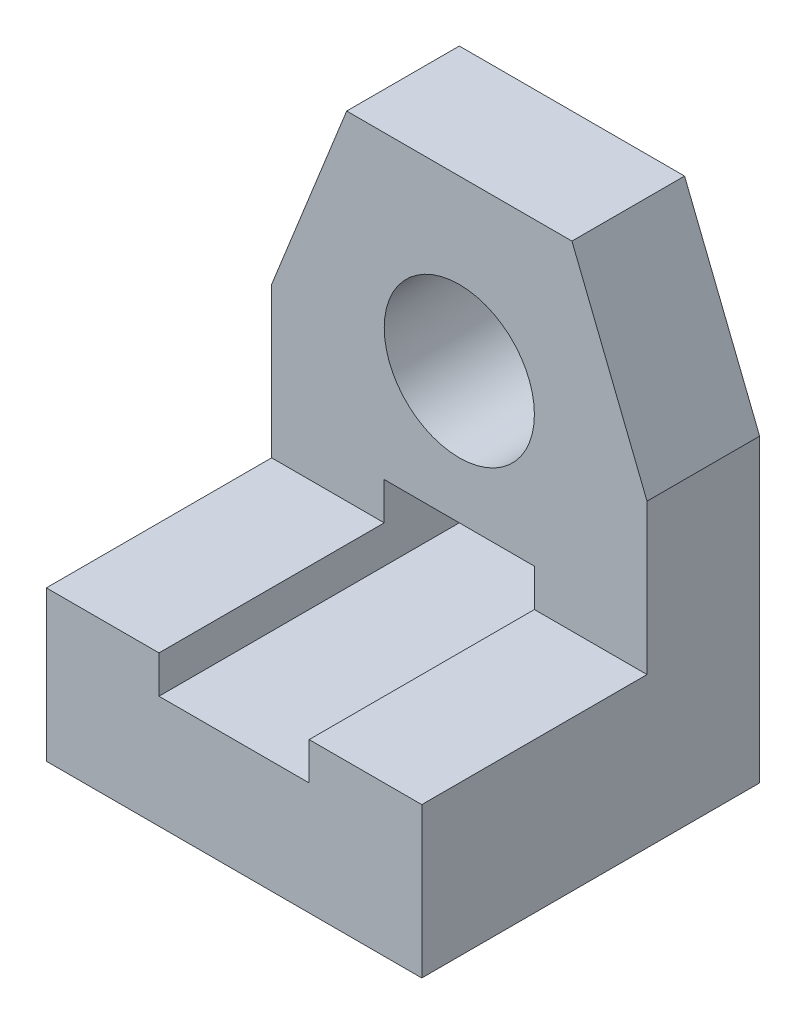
ISO-10303-21;
HEADER;
FILE_DESCRIPTION(('STEP AP214'),'2;1');
FILE_NAME('part.step','',(''),(''),'','','');
FILE_SCHEMA(('AUTOMOTIVE_DESIGN { 1 0 10303 214 1 1 1 1 }'));
ENDSEC;
DATA;
#1=APPLICATION_CONTEXT('core data for automotive mechanical design processes');
#2=APPLICATION_PROTOCOL_DEFINITION('international standard','automotive_design',2000,#1);
#3=PRODUCT_CONTEXT('',#1,'mechanical');
#4=PRODUCT('Part','Part','',(#3));
#5=PRODUCT_RELATED_PRODUCT_CATEGORY('part','',(#4));
#6=PRODUCT_DEFINITION_FORMATION('','',#4);
#7=PRODUCT_DEFINITION_CONTEXT('part definition',#1,'design');
#8=PRODUCT_DEFINITION('design','',#6,#7);
#9=PRODUCT_DEFINITION_SHAPE('','',#8);
#10=(LENGTH_UNIT() NAMED_UNIT(*) SI_UNIT(.MILLI.,.METRE.));
#11=(NAMED_UNIT(*) PLANE_ANGLE_UNIT() SI_UNIT($,.RADIAN.));
#12=(NAMED_UNIT(*) SI_UNIT($,.STERADIAN.) SOLID_ANGLE_UNIT());
#13=UNCERTAINTY_MEASURE_WITH_UNIT(LENGTH_MEASURE(1.E-05),#10,'distance_accuracy_value','');
#14=(GEOMETRIC_REPRESENTATION_CONTEXT(3) GLOBAL_UNCERTAINTY_ASSIGNED_CONTEXT((#13)) GLOBAL_UNIT_ASSIGNED_CONTEXT((#10,
#11,#12)) REPRESENTATION_CONTEXT('',''));
#15=CARTESIAN_POINT('',(0.,0.,0.));
#16=DIRECTION('',(0.,0.,1.));
#17=DIRECTION('',(1.,0.,0.));
#18=AXIS2_PLACEMENT_3D('',#15,#16,#17);
#19=CARTESIAN_POINT('',(0.,20.,-45.));
#20=DIRECTION('',(0.,-1.,0.));
#21=DIRECTION('',(0.,0.,-1.));
#22=AXIS2_PLACEMENT_3D('',#19,#20,#21);
#23=PLANE('',#22);
#24=DIRECTION('',(1.,0.,0.));
#25=VECTOR('',#24,1.);
#26=CARTESIAN_POINT('',(0.,20.,0.));
#27=LINE('',#26,#25);
#28=CARTESIAN_POINT('',(0.,20.,0.));
#29=VERTEX_POINT('',#28);
#30=CARTESIAN_POINT('',(15.,20.,0.));
#31=VERTEX_POINT('',#30);
#32=EDGE_CURVE('E214',#29,#31,#27,.T.);
#33=ORIENTED_EDGE('',*,*,#32,.T.);
#34=DIRECTION('',(0.,0.,-1.));
#35=VECTOR('',#34,1.);
#36=CARTESIAN_POINT('',(15.,20.,-45.));
#37=LINE('',#36,#35);
#38=CARTESIAN_POINT('',(15.,20.,-30.));
#39=VERTEX_POINT('',#38);
#40=EDGE_CURVE('E169',#31,#39,#37,.T.);
#41=ORIENTED_EDGE('',*,*,#40,.T.);
#42=DIRECTION('',(-1.,0.,0.));
#43=VECTOR('',#42,1.);
#44=CARTESIAN_POINT('',(0.,20.,-30.));
#45=LINE('',#44,#43);
#46=CARTESIAN_POINT('',(0.,20.,-30.));
#47=VERTEX_POINT('',#46);
#48=EDGE_CURVE('E189',#39,#47,#45,.T.);
#49=ORIENTED_EDGE('',*,*,#48,.T.);
#50=DIRECTION('',(0.,0.,1.));
#51=VECTOR('',#50,1.);
#52=CARTESIAN_POINT('',(0.,20.,0.));
#53=LINE('',#52,#51);
#54=EDGE_CURVE('E212',#47,#29,#53,.T.);
#55=ORIENTED_EDGE('',*,*,#54,.T.);
#56=EDGE_LOOP('',(#33,#41,#49,#55));
#57=FACE_BOUND('',#56,.T.);
#58=ADVANCED_FACE('F31',(#57),#23,.F.);
#59=CARTESIAN_POINT('',(0.,20.,0.));
#60=DIRECTION('',(1.,0.,0.));
#61=DIRECTION('',(0.,0.,-1.));
#62=AXIS2_PLACEMENT_3D('',#59,#60,#61);
#63=PLANE('',#62);
#64=DIRECTION('',(0.,0.,1.));
#65=VECTOR('',#64,1.);
#66=CARTESIAN_POINT('',(0.,0.,0.));
#67=LINE('',#66,#65);
#68=CARTESIAN_POINT('',(0.,0.,-45.));
#69=VERTEX_POINT('',#68);
#70=CARTESIAN_POINT('',(0.,0.,0.));
#71=VERTEX_POINT('',#70);
#72=EDGE_CURVE('E260',#69,#71,#67,.T.);
#73=ORIENTED_EDGE('',*,*,#72,.T.);
#74=DIRECTION('',(0.,-1.,0.));
#75=VECTOR('',#74,1.);
#76=CARTESIAN_POINT('',(0.,20.,0.));
#77=LINE('',#76,#75);
#78=EDGE_CURVE('E196',#29,#71,#77,.T.);
#79=ORIENTED_EDGE('',*,*,#78,.F.);
#80=ORIENTED_EDGE('',*,*,#54,.F.);
#81=DIRECTION('',(0.,1.,0.));
#82=VECTOR('',#81,1.);
#83=CARTESIAN_POINT('',(0.,20.,-30.));
#84=LINE('',#83,#82);
#85=CARTESIAN_POINT('',(0.,40.,-30.));
#86=VERTEX_POINT('',#85);
#87=EDGE_CURVE('E208',#47,#86,#84,.T.);
#88=ORIENTED_EDGE('',*,*,#87,.T.);
#89=DIRECTION('',(0.,0.,-1.));
#90=VECTOR('',#89,1.);
#91=CARTESIAN_POINT('',(0.,40.,-30.));
#92=LINE('',#91,#90);
#93=CARTESIAN_POINT('',(0.,40.,-45.));
#94=VERTEX_POINT('',#93);
#95=EDGE_CURVE('E239',#86,#94,#92,.T.);
#96=ORIENTED_EDGE('',*,*,#95,.T.);
#97=DIRECTION('',(0.,-1.,0.));
#98=VECTOR('',#97,1.);
#99=CARTESIAN_POINT('',(0.,20.,-45.));
#100=LINE('',#99,#98);
#101=EDGE_CURVE('E271',#94,#69,#100,.T.);
#102=ORIENTED_EDGE('',*,*,#101,.T.);
#103=EDGE_LOOP('',(#73,#79,#80,#88,#96,#102));
#104=FACE_BOUND('',#103,.T.);
#105=ADVANCED_FACE('F33',(#104),#63,.F.);
#106=CARTESIAN_POINT('',(0.,20.,0.));
#107=DIRECTION('',(0.,0.,-1.));
#108=DIRECTION('',(-1.,0.,0.));
#109=AXIS2_PLACEMENT_3D('',#106,#107,#108);
#110=PLANE('',#109);
#111=DIRECTION('',(1.,0.,0.));
#112=VECTOR('',#111,1.);
#113=CARTESIAN_POINT('',(15.,15.,0.));
#114=LINE('',#113,#112);
#115=CARTESIAN_POINT('',(15.,15.,0.));
#116=VERTEX_POINT('',#115);
#117=CARTESIAN_POINT('',(35.,15.,0.));
#118=VERTEX_POINT('',#117);
#119=EDGE_CURVE('E155',#116,#118,#114,.T.);
#120=ORIENTED_EDGE('',*,*,#119,.F.);
#121=DIRECTION('',(0.,-1.,0.));
#122=VECTOR('',#121,1.);
#123=CARTESIAN_POINT('',(15.,25.,0.));
#124=LINE('',#123,#122);
#125=EDGE_CURVE('E138',#31,#116,#124,.T.);
#126=ORIENTED_EDGE('',*,*,#125,.F.);
#127=ORIENTED_EDGE('',*,*,#32,.F.);
#128=ORIENTED_EDGE('',*,*,#78,.T.);
#129=DIRECTION('',(1.,0.,0.));
#130=VECTOR('',#129,1.);
#131=CARTESIAN_POINT('',(0.,0.,0.));
#132=LINE('',#131,#130);
#133=CARTESIAN_POINT('',(50.,0.,0.));
#134=VERTEX_POINT('',#133);
#135=EDGE_CURVE('E276',#71,#134,#132,.T.);
#136=ORIENTED_EDGE('',*,*,#135,.T.);
#137=DIRECTION('',(0.,-1.,0.));
#138=VECTOR('',#137,1.);
#139=CARTESIAN_POINT('',(50.,20.,0.));
#140=LINE('',#139,#138);
#141=CARTESIAN_POINT('',(50.,20.,0.));
#142=VERTEX_POINT('',#141);
#143=EDGE_CURVE('E285',#142,#134,#140,.T.);
#144=ORIENTED_EDGE('',*,*,#143,.F.);
#145=CARTESIAN_POINT('',(35.,20.,0.));
#146=VERTEX_POINT('',#145);
#147=EDGE_CURVE('E222',#146,#142,#27,.T.);
#148=ORIENTED_EDGE('',*,*,#147,.F.);
#149=DIRECTION('',(0.,1.,0.));
#150=VECTOR('',#149,1.);
#151=CARTESIAN_POINT('',(35.,25.,0.));
#152=LINE('',#151,#150);
#153=EDGE_CURVE('E153',#118,#146,#152,.T.);
#154=ORIENTED_EDGE('',*,*,#153,.F.);
#155=EDGE_LOOP('',(#120,#126,#127,#128,#136,#144,#148,#154));
#156=FACE_BOUND('',#155,.T.);
#157=ADVANCED_FACE('F216',(#156),#110,.F.);
#158=CARTESIAN_POINT('',(50.,20.,0.));
#159=DIRECTION('',(-1.,0.,0.));
#160=DIRECTION('',(0.,0.,1.));
#161=AXIS2_PLACEMENT_3D('',#158,#159,#160);
#162=PLANE('',#161);
#163=DIRECTION('',(0.,0.,-1.));
#164=VECTOR('',#163,1.);
#165=CARTESIAN_POINT('',(50.,0.,0.));
#166=LINE('',#165,#164);
#167=CARTESIAN_POINT('',(50.,0.,-45.));
#168=VERTEX_POINT('',#167);
#169=EDGE_CURVE('E278',#134,#168,#166,.T.);
#170=ORIENTED_EDGE('',*,*,#169,.T.);
#171=DIRECTION('',(0.,-1.,0.));
#172=VECTOR('',#171,1.);
#173=CARTESIAN_POINT('',(50.,20.,-45.));
#174=LINE('',#173,#172);
#175=CARTESIAN_POINT('',(50.,40.,-45.));
#176=VERTEX_POINT('',#175);
#177=EDGE_CURVE('E283',#176,#168,#174,.T.);
#178=ORIENTED_EDGE('',*,*,#177,.F.);
#179=DIRECTION('',(0.,0.,-1.));
#180=VECTOR('',#179,1.);
#181=CARTESIAN_POINT('',(50.,40.,-30.));
#182=LINE('',#181,#180);
#183=CARTESIAN_POINT('',(50.,40.,-30.));
#184=VERTEX_POINT('',#183);
#185=EDGE_CURVE('E258',#184,#176,#182,.T.);
#186=ORIENTED_EDGE('',*,*,#185,.F.);
#187=DIRECTION('',(0.,-1.,0.));
#188=VECTOR('',#187,1.);
#189=CARTESIAN_POINT('',(50.,20.,-30.));
#190=LINE('',#189,#188);
#191=CARTESIAN_POINT('',(50.,20.,-30.));
#192=VERTEX_POINT('',#191);
#193=EDGE_CURVE('E238',#184,#192,#190,.T.);
#194=ORIENTED_EDGE('',*,*,#193,.T.);
#195=DIRECTION('',(0.,0.,-1.));
#196=VECTOR('',#195,1.);
#197=CARTESIAN_POINT('',(50.,20.,0.));
#198=LINE('',#197,#196);
#199=EDGE_CURVE('E229',#142,#192,#198,.T.);
#200=ORIENTED_EDGE('',*,*,#199,.F.);
#201=ORIENTED_EDGE('',*,*,#143,.T.);
#202=EDGE_LOOP('',(#170,#178,#186,#194,#200,#201));
#203=FACE_BOUND('',#202,.T.);
#204=ADVANCED_FACE('F292',(#203),#162,.F.);
#205=CARTESIAN_POINT('',(0.,20.,-45.));
#206=DIRECTION('',(0.,0.,1.));
#207=DIRECTION('',(1.,0.,0.));
#208=AXIS2_PLACEMENT_3D('',#205,#206,#207);
#209=PLANE('',#208);
#210=DIRECTION('',(-1.,0.,0.));
#211=VECTOR('',#210,1.);
#212=CARTESIAN_POINT('',(15.,25.,-45.));
#213=LINE('',#212,#211);
#214=CARTESIAN_POINT('',(35.,25.,-45.));
#215=VERTEX_POINT('',#214);
#216=CARTESIAN_POINT('',(15.,25.,-45.));
#217=VERTEX_POINT('',#216);
#218=EDGE_CURVE('E143',#215,#217,#213,.T.);
#219=ORIENTED_EDGE('',*,*,#218,.T.);
#220=DIRECTION('',(0.,-1.,0.));
#221=VECTOR('',#220,1.);
#222=CARTESIAN_POINT('',(15.,25.,-45.));
#223=LINE('',#222,#221);
#224=CARTESIAN_POINT('',(15.,15.,-45.));
#225=VERTEX_POINT('',#224);
#226=EDGE_CURVE('E135',#217,#225,#223,.T.);
#227=ORIENTED_EDGE('',*,*,#226,.T.);
#228=DIRECTION('',(1.,0.,0.));
#229=VECTOR('',#228,1.);
#230=CARTESIAN_POINT('',(15.,15.,-45.));
#231=LINE('',#230,#229);
#232=CARTESIAN_POINT('',(35.,15.,-45.));
#233=VERTEX_POINT('',#232);
#234=EDGE_CURVE('E146',#225,#233,#231,.T.);
#235=ORIENTED_EDGE('',*,*,#234,.T.);
#236=DIRECTION('',(0.,1.,0.));
#237=VECTOR('',#236,1.);
#238=CARTESIAN_POINT('',(35.,25.,-45.));
#239=LINE('',#238,#237);
#240=EDGE_CURVE('E46',#233,#215,#239,.T.);
#241=ORIENTED_EDGE('',*,*,#240,.T.);
#242=EDGE_LOOP('',(#219,#227,#235,#241));
#243=FACE_BOUND('',#242,.T.);
#244=DIRECTION('',(-1.,0.,0.));
#245=VECTOR('',#244,1.);
#246=CARTESIAN_POINT('',(0.,0.,-45.));
#247=LINE('',#246,#245);
#248=EDGE_CURVE('E269',#168,#69,#247,.T.);
#249=ORIENTED_EDGE('',*,*,#248,.T.);
#250=ORIENTED_EDGE('',*,*,#101,.F.);
#251=DIRECTION('',(0.371390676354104,0.928476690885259,0.));
#252=VECTOR('',#251,1.);
#253=CARTESIAN_POINT('',(0.,40.,-45.));
#254=LINE('',#253,#252);
#255=CARTESIAN_POINT('',(9.99999999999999,65.,-45.));
#256=VERTEX_POINT('',#255);
#257=EDGE_CURVE('E176',#94,#256,#254,.T.);
#258=ORIENTED_EDGE('',*,*,#257,.T.);
#259=DIRECTION('',(1.,0.,0.));
#260=VECTOR('',#259,1.);
#261=CARTESIAN_POINT('',(40.,65.,-45.));
#262=LINE('',#261,#260);
#263=CARTESIAN_POINT('',(40.,65.,-45.));
#264=VERTEX_POINT('',#263);
#265=EDGE_CURVE('E253',#256,#264,#262,.T.);
#266=ORIENTED_EDGE('',*,*,#265,.T.);
#267=DIRECTION('',(0.371390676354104,-0.928476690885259,0.));
#268=VECTOR('',#267,1.);
#269=CARTESIAN_POINT('',(50.,40.,-45.));
#270=LINE('',#269,#268);
#271=EDGE_CURVE('E192',#264,#176,#270,.T.);
#272=ORIENTED_EDGE('',*,*,#271,.T.);
#273=ORIENTED_EDGE('',*,*,#177,.T.);
#274=EDGE_LOOP('',(#249,#250,#258,#266,#272,#273));
#275=FACE_BOUND('',#274,.T.);
#276=CARTESIAN_POINT('',(25.,42.5,-45.));
#277=DIRECTION('',(0.,0.,-1.));
#278=DIRECTION('',(-1.,0.,0.));
#279=AXIS2_PLACEMENT_3D('',#276,#277,#278);
#280=CIRCLE('',#279,10.);
#281=CARTESIAN_POINT('',(15.,42.5,-45.));
#282=VERTEX_POINT('',#281);
#283=EDGE_CURVE('E172',#282,#282,#280,.T.);
#284=ORIENTED_EDGE('',*,*,#283,.F.);
#285=EDGE_LOOP('',(#284));
#286=FACE_BOUND('',#285,.T.);
#287=ADVANCED_FACE('F150',(#243,#275,#286),#209,.F.);
#288=CARTESIAN_POINT('',(35.,20.,-30.));
#289=VERTEX_POINT('',#288);
#290=EDGE_CURVE('E185',#192,#289,#45,.T.);
#291=ORIENTED_EDGE('',*,*,#290,.T.);
#292=DIRECTION('',(0.,0.,1.));
#293=VECTOR('',#292,1.);
#294=CARTESIAN_POINT('',(35.,20.,-45.));
#295=LINE('',#294,#293);
#296=EDGE_CURVE('E53',#289,#146,#295,.T.);
#297=ORIENTED_EDGE('',*,*,#296,.T.);
#298=ORIENTED_EDGE('',*,*,#147,.T.);
#299=ORIENTED_EDGE('',*,*,#199,.T.);
#300=EDGE_LOOP('',(#291,#297,#298,#299));
#301=FACE_BOUND('',#300,.T.);
#302=ADVANCED_FACE('F226',(#301),#23,.F.);
#303=CARTESIAN_POINT('',(0.,0.,-45.));
#304=DIRECTION('',(0.,-1.,0.));
#305=DIRECTION('',(0.,0.,-1.));
#306=AXIS2_PLACEMENT_3D('',#303,#304,#305);
#307=PLANE('',#306);
#308=ORIENTED_EDGE('',*,*,#72,.F.);
#309=ORIENTED_EDGE('',*,*,#248,.F.);
#310=ORIENTED_EDGE('',*,*,#169,.F.);
#311=ORIENTED_EDGE('',*,*,#135,.F.);
#312=EDGE_LOOP('',(#308,#309,#310,#311));
#313=FACE_BOUND('',#312,.T.);
#314=ADVANCED_FACE('F291',(#313),#307,.T.);
#315=CARTESIAN_POINT('',(50.,40.,-30.));
#316=DIRECTION('',(0.928476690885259,0.371390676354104,0.));
#317=DIRECTION('',(-0.371390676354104,0.928476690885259,0.));
#318=AXIS2_PLACEMENT_3D('',#315,#316,#317);
#319=PLANE('',#318);
#320=ORIENTED_EDGE('',*,*,#271,.F.);
#321=DIRECTION('',(0.,0.,-1.));
#322=VECTOR('',#321,1.);
#323=CARTESIAN_POINT('',(40.,65.,-30.));
#324=LINE('',#323,#322);
#325=CARTESIAN_POINT('',(40.,65.,-30.));
#326=VERTEX_POINT('',#325);
#327=EDGE_CURVE('E261',#326,#264,#324,.T.);
#328=ORIENTED_EDGE('',*,*,#327,.F.);
#329=DIRECTION('',(0.371390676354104,-0.928476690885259,0.));
#330=VECTOR('',#329,1.);
#331=CARTESIAN_POINT('',(50.,40.,-30.));
#332=LINE('',#331,#330);
#333=EDGE_CURVE('E240',#326,#184,#332,.T.);
#334=ORIENTED_EDGE('',*,*,#333,.T.);
#335=ORIENTED_EDGE('',*,*,#185,.T.);
#336=EDGE_LOOP('',(#320,#328,#334,#335));
#337=FACE_BOUND('',#336,.T.);
#338=ADVANCED_FACE('F296',(#337),#319,.T.);
#339=CARTESIAN_POINT('',(40.,65.,-30.));
#340=DIRECTION('',(0.,1.,0.));
#341=DIRECTION('',(0.,0.,1.));
#342=AXIS2_PLACEMENT_3D('',#339,#340,#341);
#343=PLANE('',#342);
#344=ORIENTED_EDGE('',*,*,#265,.F.);
#345=DIRECTION('',(0.,0.,-1.));
#346=VECTOR('',#345,1.);
#347=CARTESIAN_POINT('',(9.99999999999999,65.,-30.));
#348=LINE('',#347,#346);
#349=CARTESIAN_POINT('',(9.99999999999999,65.,-30.));
#350=VERTEX_POINT('',#349);
#351=EDGE_CURVE('E242',#350,#256,#348,.T.);
#352=ORIENTED_EDGE('',*,*,#351,.F.);
#353=DIRECTION('',(1.,0.,0.));
#354=VECTOR('',#353,1.);
#355=CARTESIAN_POINT('',(40.,65.,-30.));
#356=LINE('',#355,#354);
#357=EDGE_CURVE('E235',#350,#326,#356,.T.);
#358=ORIENTED_EDGE('',*,*,#357,.T.);
#359=ORIENTED_EDGE('',*,*,#327,.T.);
#360=EDGE_LOOP('',(#344,#352,#358,#359));
#361=FACE_BOUND('',#360,.T.);
#362=ADVANCED_FACE('F299',(#361),#343,.T.);
#363=CARTESIAN_POINT('',(0.,40.,-30.));
#364=DIRECTION('',(-0.928476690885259,0.371390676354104,0.));
#365=DIRECTION('',(-0.371390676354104,-0.928476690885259,0.));
#366=AXIS2_PLACEMENT_3D('',#363,#364,#365);
#367=PLANE('',#366);
#368=ORIENTED_EDGE('',*,*,#257,.F.);
#369=ORIENTED_EDGE('',*,*,#95,.F.);
#370=DIRECTION('',(0.371390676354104,0.928476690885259,0.));
#371=VECTOR('',#370,1.);
#372=CARTESIAN_POINT('',(0.,40.,-30.));
#373=LINE('',#372,#371);
#374=EDGE_CURVE('E181',#86,#350,#373,.T.);
#375=ORIENTED_EDGE('',*,*,#374,.T.);
#376=ORIENTED_EDGE('',*,*,#351,.T.);
#377=EDGE_LOOP('',(#368,#369,#375,#376));
#378=FACE_BOUND('',#377,.T.);
#379=ADVANCED_FACE('F302',(#378),#367,.T.);
#380=CARTESIAN_POINT('',(50.,20.,-30.));
#381=DIRECTION('',(0.,0.,1.));
#382=DIRECTION('',(1.,0.,0.));
#383=AXIS2_PLACEMENT_3D('',#380,#381,#382);
#384=PLANE('',#383);
#385=DIRECTION('',(0.,-1.,0.));
#386=VECTOR('',#385,1.);
#387=CARTESIAN_POINT('',(15.,20.,-30.));
#388=LINE('',#387,#386);
#389=CARTESIAN_POINT('',(15.,25.,-30.));
#390=VERTEX_POINT('',#389);
#391=EDGE_CURVE('E11',#390,#39,#388,.T.);
#392=ORIENTED_EDGE('',*,*,#391,.F.);
#393=DIRECTION('',(-1.,0.,0.));
#394=VECTOR('',#393,1.);
#395=CARTESIAN_POINT('',(50.,25.,-30.));
#396=LINE('',#395,#394);
#397=CARTESIAN_POINT('',(35.,25.,-30.));
#398=VERTEX_POINT('',#397);
#399=EDGE_CURVE('E39',#398,#390,#396,.T.);
#400=ORIENTED_EDGE('',*,*,#399,.F.);
#401=DIRECTION('',(0.,1.,0.));
#402=VECTOR('',#401,1.);
#403=CARTESIAN_POINT('',(35.,20.,-30.));
#404=LINE('',#403,#402);
#405=EDGE_CURVE('E195',#289,#398,#404,.T.);
#406=ORIENTED_EDGE('',*,*,#405,.F.);
#407=ORIENTED_EDGE('',*,*,#290,.F.);
#408=ORIENTED_EDGE('',*,*,#193,.F.);
#409=ORIENTED_EDGE('',*,*,#333,.F.);
#410=ORIENTED_EDGE('',*,*,#357,.F.);
#411=ORIENTED_EDGE('',*,*,#374,.F.);
#412=ORIENTED_EDGE('',*,*,#87,.F.);
#413=ORIENTED_EDGE('',*,*,#48,.F.);
#414=EDGE_LOOP('',(#392,#400,#406,#407,#408,#409,#410,#411,#412,#413));
#415=FACE_BOUND('',#414,.T.);
#416=CARTESIAN_POINT('',(25.,42.5,-30.));
#417=DIRECTION('',(0.,0.,-1.));
#418=DIRECTION('',(-1.,0.,0.));
#419=AXIS2_PLACEMENT_3D('',#416,#417,#418);
#420=CIRCLE('',#419,10.);
#421=CARTESIAN_POINT('',(15.,42.5,-30.));
#422=VERTEX_POINT('',#421);
#423=EDGE_CURVE('E173',#422,#422,#420,.T.);
#424=ORIENTED_EDGE('',*,*,#423,.T.);
#425=EDGE_LOOP('',(#424));
#426=FACE_BOUND('',#425,.T.);
#427=ADVANCED_FACE('F203',(#415,#426),#384,.T.);
#428=CARTESIAN_POINT('',(25.,42.5,-30.));
#429=DIRECTION('',(0.,0.,-1.));
#430=DIRECTION('',(-1.,0.,0.));
#431=AXIS2_PLACEMENT_3D('',#428,#429,#430);
#432=CYLINDRICAL_SURFACE('',#431,10.);
#433=ORIENTED_EDGE('',*,*,#423,.F.);
#434=EDGE_LOOP('',(#433));
#435=FACE_BOUND('',#434,.T.);
#436=ORIENTED_EDGE('',*,*,#283,.T.);
#437=EDGE_LOOP('',(#436));
#438=FACE_BOUND('',#437,.T.);
#439=ADVANCED_FACE('F309',(#435,#438),#432,.F.);
#440=CARTESIAN_POINT('',(15.,25.,-45.));
#441=DIRECTION('',(-1.,0.,0.));
#442=DIRECTION('',(0.,0.,1.));
#443=AXIS2_PLACEMENT_3D('',#440,#441,#442);
#444=PLANE('',#443);
#445=ORIENTED_EDGE('',*,*,#125,.T.);
#446=DIRECTION('',(0.,0.,1.));
#447=VECTOR('',#446,1.);
#448=CARTESIAN_POINT('',(15.,15.,-45.));
#449=LINE('',#448,#447);
#450=EDGE_CURVE('E130',#225,#116,#449,.T.);
#451=ORIENTED_EDGE('',*,*,#450,.F.);
#452=ORIENTED_EDGE('',*,*,#226,.F.);
#453=DIRECTION('',(0.,0.,1.));
#454=VECTOR('',#453,1.);
#455=CARTESIAN_POINT('',(15.,25.,-45.));
#456=LINE('',#455,#454);
#457=EDGE_CURVE('E162',#217,#390,#456,.T.);
#458=ORIENTED_EDGE('',*,*,#457,.T.);
#459=ORIENTED_EDGE('',*,*,#391,.T.);
#460=ORIENTED_EDGE('',*,*,#40,.F.);
#461=EDGE_LOOP('',(#445,#451,#452,#458,#459,#460));
#462=FACE_BOUND('',#461,.T.);
#463=ADVANCED_FACE('F132',(#462),#444,.F.);
#464=CARTESIAN_POINT('',(35.,25.,-45.));
#465=DIRECTION('',(1.,0.,0.));
#466=DIRECTION('',(0.,0.,-1.));
#467=AXIS2_PLACEMENT_3D('',#464,#465,#466);
#468=PLANE('',#467);
#469=ORIENTED_EDGE('',*,*,#405,.T.);
#470=DIRECTION('',(0.,0.,1.));
#471=VECTOR('',#470,1.);
#472=CARTESIAN_POINT('',(35.,25.,-45.));
#473=LINE('',#472,#471);
#474=EDGE_CURVE('E164',#215,#398,#473,.T.);
#475=ORIENTED_EDGE('',*,*,#474,.F.);
#476=ORIENTED_EDGE('',*,*,#240,.F.);
#477=DIRECTION('',(0.,0.,1.));
#478=VECTOR('',#477,1.);
#479=CARTESIAN_POINT('',(35.,15.,-45.));
#480=LINE('',#479,#478);
#481=EDGE_CURVE('E142',#233,#118,#480,.T.);
#482=ORIENTED_EDGE('',*,*,#481,.T.);
#483=ORIENTED_EDGE('',*,*,#153,.T.);
#484=ORIENTED_EDGE('',*,*,#296,.F.);
#485=EDGE_LOOP('',(#469,#475,#476,#482,#483,#484));
#486=FACE_BOUND('',#485,.T.);
#487=ADVANCED_FACE('F223',(#486),#468,.F.);
#488=CARTESIAN_POINT('',(15.,25.,-45.));
#489=DIRECTION('',(0.,1.,0.));
#490=DIRECTION('',(0.,0.,1.));
#491=AXIS2_PLACEMENT_3D('',#488,#489,#490);
#492=PLANE('',#491);
#493=ORIENTED_EDGE('',*,*,#399,.T.);
#494=ORIENTED_EDGE('',*,*,#457,.F.);
#495=ORIENTED_EDGE('',*,*,#218,.F.);
#496=ORIENTED_EDGE('',*,*,#474,.T.);
#497=EDGE_LOOP('',(#493,#494,#495,#496));
#498=FACE_BOUND('',#497,.T.);
#499=ADVANCED_FACE('F199',(#498),#492,.F.);
#500=CARTESIAN_POINT('',(15.,15.,-45.));
#501=DIRECTION('',(0.,-1.,0.));
#502=DIRECTION('',(0.,0.,-1.));
#503=AXIS2_PLACEMENT_3D('',#500,#501,#502);
#504=PLANE('',#503);
#505=ORIENTED_EDGE('',*,*,#119,.T.);
#506=ORIENTED_EDGE('',*,*,#481,.F.);
#507=ORIENTED_EDGE('',*,*,#234,.F.);
#508=ORIENTED_EDGE('',*,*,#450,.T.);
#509=EDGE_LOOP('',(#505,#506,#507,#508));
#510=FACE_BOUND('',#509,.T.);
#511=ADVANCED_FACE('F147',(#510),#504,.F.);
#512=CLOSED_SHELL('',(#58,#105,#157,#204,#287,#302,#314,#338,#362,#379,#427,#439,#463,#487,#499,#511));
#513=MANIFOLD_SOLID_BREP('B2',#512);
#514=ADVANCED_BREP_SHAPE_REPRESENTATION('',(#18,#513),#14);
#515=SHAPE_DEFINITION_REPRESENTATION(#9,#514);
ENDSEC;
END-ISO-10303-21;
